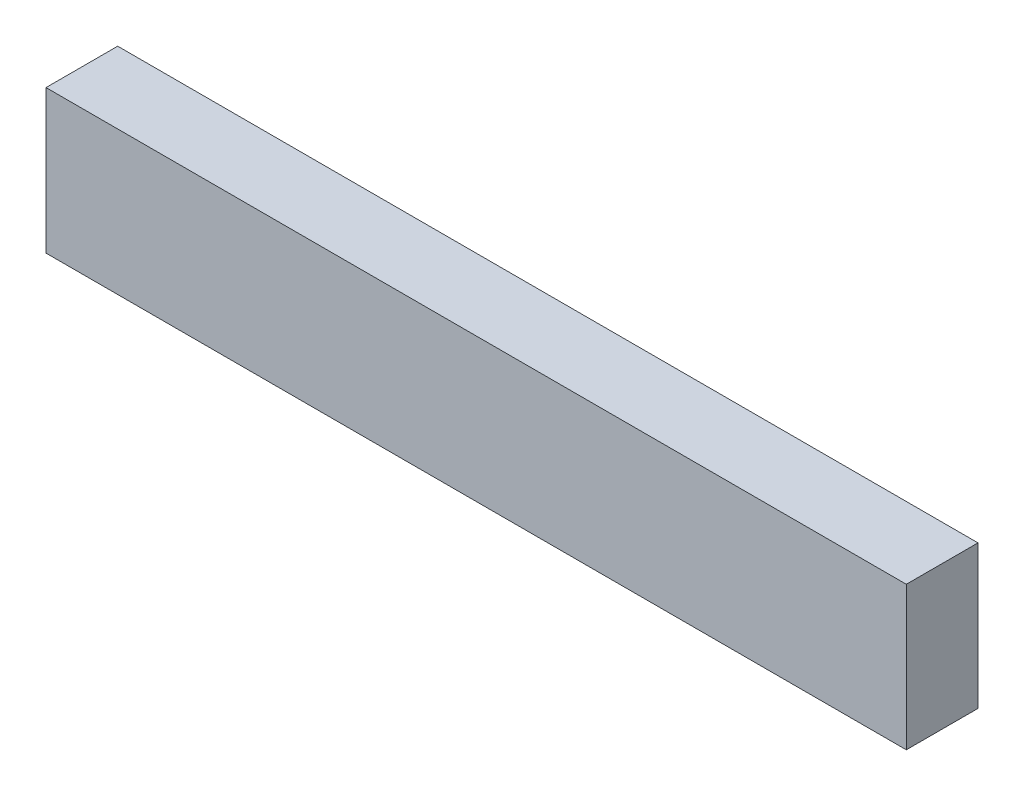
from build123d import *

# Parameters (mm, degrees)
SKIZZE1_W               = 120
SKIZZE1_H               = 20
LINEAR_AUSTRAGEN1_DEPTH = 10


with BuildPart() as part:
    # Skizze1 → Linear austragen1 (new body)
    with BuildSketch(Plane.XY):
        with Locations((-1.83442623, -0.55307377)):
            Rectangle(SKIZZE1_W, SKIZZE1_H)
    extrude(amount=LINEAR_AUSTRAGEN1_DEPTH)


solid = part.part
